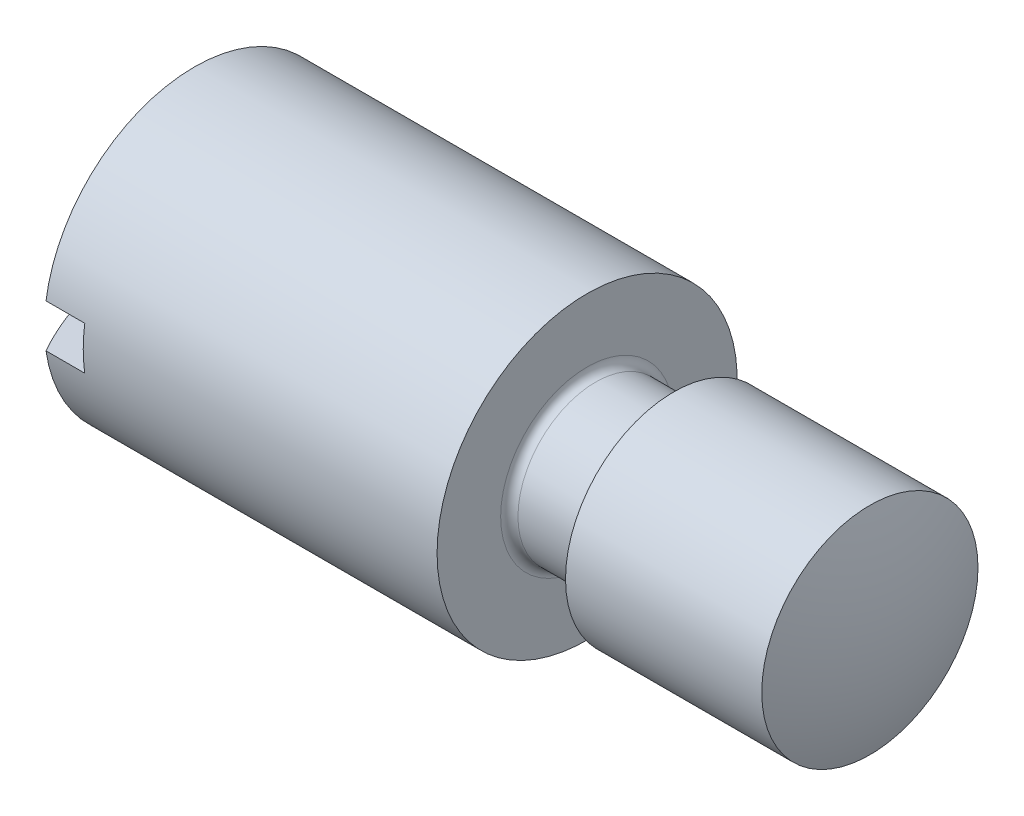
from build123d import *

# Parameters (mm, degrees)
CUT_EXTRUDE1_DEPTH      = 9.847058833
CUT_EXTRUDE1_DEPTH_BACK = 9.847058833
FILLET2_R               = 0.1


with BuildPart() as part:
    # Sketch1 → Revolve1 (revolve)
    with BuildSketch(Plane(origin=(9.966231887, 0, 1.735), x_dir=(1, 0, 0), z_dir=(0, 1, 0)), mode=Mode.PRIVATE) as revolve1_sk:
        with BuildLine():
            Line((-1.466231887, 1.735), (-9.966231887, 1.735))
            ThreePointArc((-9.966231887, 1.735), (-9.849200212, 2.63251062), (-9.505931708, 3.47))
            Line((-9.505931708, 3.47), (-4.966231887, 3.47))
            Line((-4.966231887, 3.47), (-4.966231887, 2.635))
            Line((-4.966231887, 2.635), (-3.966231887, 2.635))
            Line((-3.966231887, 2.635), (-3.966231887, 2.985))
            Line((-3.966231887, 2.985), (-1.697057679, 2.985))
            ThreePointArc((-1.697057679, 2.985), (-1.524422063, 2.370566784), (-1.466231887, 1.735))
        make_face()
    revolve(revolve1_sk.sketch.rotate(Axis((-4.498735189, 0, 0), (1, 0, 0)), 180), axis=Axis((-4.498735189, 0, 0), (1, 0, 0)))

    # Sketch2 → Cut-Extrude1 (cut, two sides: drawn at the far end of the back side and taken through both)
    with BuildSketch(Plane.XY.offset(-CUT_EXTRUDE1_DEPTH_BACK)):
        with BuildLine():
            Line((0.908939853, 0.25), (0.008939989, 0.25))
            ThreePointArc((0.008939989, 0.25), (-0.241060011, 0), (0.008939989, -0.25))
            Line((0.008939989, -0.25), (0.908939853, -0.25))
            Line((0.908939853, -0.25), (0.908939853, 0.25))
        make_face()
    extrude(amount=CUT_EXTRUDE1_DEPTH + CUT_EXTRUDE1_DEPTH_BACK, mode=Mode.SUBTRACT)

    # Fillet2
    fillet2_edges = [part.edges().sort_by_distance(p)[0] for p in [
        (5, 0, -0.9),
        (6, 0, -0.9),
    ]]
    fillet(fillet2_edges, radius=FILLET2_R)


solid = part.part
